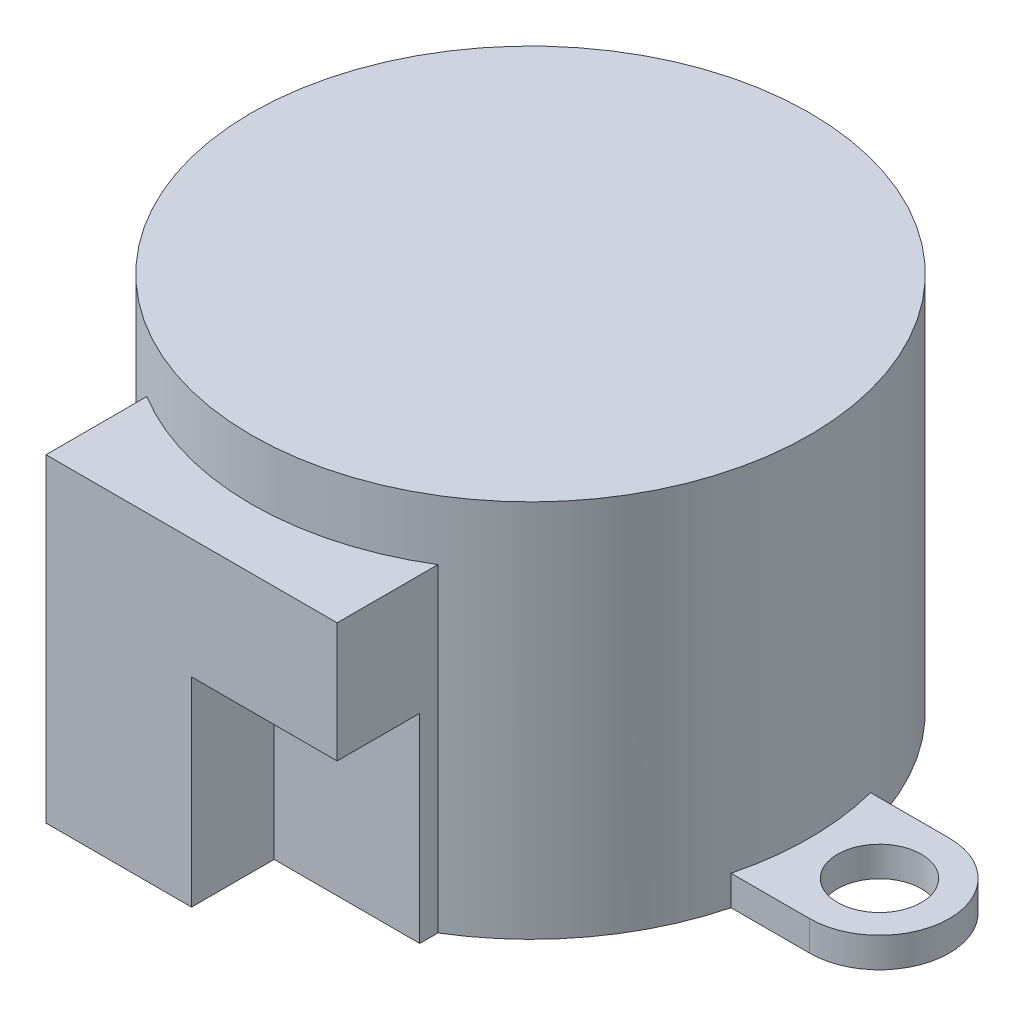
ISO-10303-21;
HEADER;
FILE_DESCRIPTION(('STEP AP214'),'2;1');
FILE_NAME('part.step','',(''),(''),'','','');
FILE_SCHEMA(('AUTOMOTIVE_DESIGN { 1 0 10303 214 1 1 1 1 }'));
ENDSEC;
DATA;
#1=APPLICATION_CONTEXT('core data for automotive mechanical design processes');
#2=APPLICATION_PROTOCOL_DEFINITION('international standard','automotive_design',2000,#1);
#3=PRODUCT_CONTEXT('',#1,'mechanical');
#4=PRODUCT('Part','Part','',(#3));
#5=PRODUCT_RELATED_PRODUCT_CATEGORY('part','',(#4));
#6=PRODUCT_DEFINITION_FORMATION('','',#4);
#7=PRODUCT_DEFINITION_CONTEXT('part definition',#1,'design');
#8=PRODUCT_DEFINITION('design','',#6,#7);
#9=PRODUCT_DEFINITION_SHAPE('','',#8);
#10=(LENGTH_UNIT() NAMED_UNIT(*) SI_UNIT(.MILLI.,.METRE.));
#11=(NAMED_UNIT(*) PLANE_ANGLE_UNIT() SI_UNIT($,.RADIAN.));
#12=(NAMED_UNIT(*) SI_UNIT($,.STERADIAN.) SOLID_ANGLE_UNIT());
#13=UNCERTAINTY_MEASURE_WITH_UNIT(LENGTH_MEASURE(1.E-05),#10,'distance_accuracy_value','');
#14=(GEOMETRIC_REPRESENTATION_CONTEXT(3) GLOBAL_UNCERTAINTY_ASSIGNED_CONTEXT((#13)) GLOBAL_UNIT_ASSIGNED_CONTEXT((#10,
#11,#12)) REPRESENTATION_CONTEXT('',''));
#15=CARTESIAN_POINT('',(0.,0.,0.));
#16=DIRECTION('',(0.,0.,1.));
#17=DIRECTION('',(1.,0.,0.));
#18=AXIS2_PLACEMENT_3D('',#15,#16,#17);
#19=CARTESIAN_POINT('',(0.,19.,0.));
#20=DIRECTION('',(0.,-1.,0.));
#21=DIRECTION('',(0.,0.,-1.));
#22=AXIS2_PLACEMENT_3D('',#19,#20,#21);
#23=CYLINDRICAL_SURFACE('',#22,14.);
#24=CARTESIAN_POINT('',(0.,19.,0.));
#25=DIRECTION('',(0.,1.,0.));
#26=DIRECTION('',(0.,0.,1.));
#27=AXIS2_PLACEMENT_3D('',#24,#25,#26);
#28=CIRCLE('',#27,14.);
#29=CARTESIAN_POINT('',(0.,19.,14.));
#30=VERTEX_POINT('',#29);
#31=EDGE_CURVE('E320',#30,#30,#28,.T.);
#32=ORIENTED_EDGE('',*,*,#31,.F.);
#33=EDGE_LOOP('',(#32));
#34=FACE_BOUND('',#33,.T.);
#35=DIRECTION('',(0.,-1.,0.));
#36=VECTOR('',#35,1.);
#37=CARTESIAN_POINT('',(-13.555441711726,1.5,3.5));
#38=LINE('',#37,#36);
#39=CARTESIAN_POINT('',(-13.555441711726,1.5,3.5));
#40=VERTEX_POINT('',#39);
#41=CARTESIAN_POINT('',(-13.555441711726,0.,3.5));
#42=VERTEX_POINT('',#41);
#43=EDGE_CURVE('E246',#40,#42,#38,.T.);
#44=ORIENTED_EDGE('',*,*,#43,.T.);
#45=CARTESIAN_POINT('',(0.,0.,0.));
#46=DIRECTION('',(0.,1.,0.));
#47=DIRECTION('',(0.,0.,1.));
#48=AXIS2_PLACEMENT_3D('',#45,#46,#47);
#49=CIRCLE('',#48,14.);
#50=CARTESIAN_POINT('',(-7.3,0.,11.9461290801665));
#51=VERTEX_POINT('',#50);
#52=EDGE_CURVE('E319',#42,#51,#49,.T.);
#53=ORIENTED_EDGE('',*,*,#52,.T.);
#54=DIRECTION('',(0.,-1.,0.));
#55=VECTOR('',#54,1.);
#56=CARTESIAN_POINT('',(-7.3,19.,11.9461290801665));
#57=LINE('',#56,#55);
#58=CARTESIAN_POINT('',(-7.3,16.,11.9461290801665));
#59=VERTEX_POINT('',#58);
#60=EDGE_CURVE('E11',#59,#51,#57,.T.);
#61=ORIENTED_EDGE('',*,*,#60,.F.);
#62=CARTESIAN_POINT('',(0.,16.,0.));
#63=DIRECTION('',(0.,-1.,0.));
#64=DIRECTION('',(0.,0.,1.));
#65=AXIS2_PLACEMENT_3D('',#62,#63,#64);
#66=CIRCLE('',#65,14.);
#67=CARTESIAN_POINT('',(7.3,16.,11.9461290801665));
#68=VERTEX_POINT('',#67);
#69=EDGE_CURVE('E250',#68,#59,#66,.T.);
#70=ORIENTED_EDGE('',*,*,#69,.F.);
#71=DIRECTION('',(0.,-1.,0.));
#72=VECTOR('',#71,1.);
#73=CARTESIAN_POINT('',(7.3,19.,11.9461290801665));
#74=LINE('',#73,#72);
#75=CARTESIAN_POINT('',(7.3,0.,11.9461290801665));
#76=VERTEX_POINT('',#75);
#77=EDGE_CURVE('E324',#68,#76,#74,.T.);
#78=ORIENTED_EDGE('',*,*,#77,.T.);
#79=CARTESIAN_POINT('',(13.555441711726,0.,3.5));
#80=VERTEX_POINT('',#79);
#81=EDGE_CURVE('E326',#76,#80,#49,.T.);
#82=ORIENTED_EDGE('',*,*,#81,.T.);
#83=DIRECTION('',(0.,-1.,0.));
#84=VECTOR('',#83,1.);
#85=CARTESIAN_POINT('',(13.555441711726,1.5,3.5));
#86=LINE('',#85,#84);
#87=CARTESIAN_POINT('',(13.555441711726,1.5,3.5));
#88=VERTEX_POINT('',#87);
#89=EDGE_CURVE('E301',#88,#80,#86,.T.);
#90=ORIENTED_EDGE('',*,*,#89,.F.);
#91=CARTESIAN_POINT('',(0.,1.5,0.));
#92=DIRECTION('',(0.,-1.,0.));
#93=DIRECTION('',(0.,0.,-1.));
#94=AXIS2_PLACEMENT_3D('',#91,#92,#93);
#95=CIRCLE('',#94,14.);
#96=CARTESIAN_POINT('',(13.555441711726,1.5,-3.5));
#97=VERTEX_POINT('',#96);
#98=EDGE_CURVE('E267',#97,#88,#95,.T.);
#99=ORIENTED_EDGE('',*,*,#98,.F.);
#100=DIRECTION('',(0.,-1.,0.));
#101=VECTOR('',#100,1.);
#102=CARTESIAN_POINT('',(13.555441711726,1.5,-3.5));
#103=LINE('',#102,#101);
#104=CARTESIAN_POINT('',(13.555441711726,0.,-3.5));
#105=VERTEX_POINT('',#104);
#106=EDGE_CURVE('E297',#97,#105,#103,.T.);
#107=ORIENTED_EDGE('',*,*,#106,.T.);
#108=CARTESIAN_POINT('',(-13.555441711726,0.,-3.5));
#109=VERTEX_POINT('',#108);
#110=EDGE_CURVE('E330',#105,#109,#49,.T.);
#111=ORIENTED_EDGE('',*,*,#110,.T.);
#112=DIRECTION('',(0.,-1.,0.));
#113=VECTOR('',#112,1.);
#114=CARTESIAN_POINT('',(-13.555441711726,1.5,-3.5));
#115=LINE('',#114,#113);
#116=CARTESIAN_POINT('',(-13.555441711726,1.5,-3.5));
#117=VERTEX_POINT('',#116);
#118=EDGE_CURVE('E67',#117,#109,#115,.T.);
#119=ORIENTED_EDGE('',*,*,#118,.F.);
#120=CARTESIAN_POINT('',(0.,1.5,0.));
#121=DIRECTION('',(0.,-1.,0.));
#122=DIRECTION('',(0.,0.,-1.));
#123=AXIS2_PLACEMENT_3D('',#120,#121,#122);
#124=CIRCLE('',#123,14.);
#125=EDGE_CURVE('E226',#40,#117,#124,.T.);
#126=ORIENTED_EDGE('',*,*,#125,.F.);
#127=EDGE_LOOP('',(#44,#53,#61,#70,#78,#82,#90,#99,#107,#111,#119,#126));
#128=FACE_BOUND('',#127,.T.);
#129=ADVANCED_FACE('F44',(#34,#128),#23,.T.);
#130=CARTESIAN_POINT('',(-7.3,19.,11.9461290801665));
#131=DIRECTION('',(1.,0.,0.));
#132=DIRECTION('',(0.,0.,-1.));
#133=AXIS2_PLACEMENT_3D('',#130,#131,#132);
#134=PLANE('',#133);
#135=DIRECTION('',(0.,0.,1.));
#136=VECTOR('',#135,1.);
#137=CARTESIAN_POINT('',(-7.3,16.,11.9461290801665));
#138=LINE('',#137,#136);
#139=CARTESIAN_POINT('',(-7.3,16.,17.));
#140=VERTEX_POINT('',#139);
#141=EDGE_CURVE('E309',#59,#140,#138,.T.);
#142=ORIENTED_EDGE('',*,*,#141,.F.);
#143=ORIENTED_EDGE('',*,*,#60,.T.);
#144=DIRECTION('',(0.,0.,1.));
#145=VECTOR('',#144,1.);
#146=CARTESIAN_POINT('',(-7.3,0.,11.9461290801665));
#147=LINE('',#146,#145);
#148=CARTESIAN_POINT('',(-7.3,0.,17.));
#149=VERTEX_POINT('',#148);
#150=EDGE_CURVE('E329',#51,#149,#147,.T.);
#151=ORIENTED_EDGE('',*,*,#150,.T.);
#152=DIRECTION('',(0.,-1.,0.));
#153=VECTOR('',#152,1.);
#154=CARTESIAN_POINT('',(-7.3,19.,17.));
#155=LINE('',#154,#153);
#156=EDGE_CURVE('E52',#140,#149,#155,.T.);
#157=ORIENTED_EDGE('',*,*,#156,.F.);
#158=EDGE_LOOP('',(#142,#143,#151,#157));
#159=FACE_BOUND('',#158,.T.);
#160=ADVANCED_FACE('F349',(#159),#134,.F.);
#161=CARTESIAN_POINT('',(-7.3,19.,17.));
#162=DIRECTION('',(0.,0.,-1.));
#163=DIRECTION('',(-1.,0.,0.));
#164=AXIS2_PLACEMENT_3D('',#161,#162,#163);
#165=PLANE('',#164);
#166=DIRECTION('',(1.,0.,0.));
#167=VECTOR('',#166,1.);
#168=CARTESIAN_POINT('',(-7.3,0.,17.));
#169=LINE('',#168,#167);
#170=CARTESIAN_POINT('',(0.,0.,17.));
#171=VERTEX_POINT('',#170);
#172=EDGE_CURVE('E174',#149,#171,#169,.T.);
#173=ORIENTED_EDGE('',*,*,#172,.T.);
#174=DIRECTION('',(0.,-1.,0.));
#175=VECTOR('',#174,1.);
#176=CARTESIAN_POINT('',(0.,10.,17.));
#177=LINE('',#176,#175);
#178=CARTESIAN_POINT('',(0.,10.,17.));
#179=VERTEX_POINT('',#178);
#180=EDGE_CURVE('E59',#179,#171,#177,.T.);
#181=ORIENTED_EDGE('',*,*,#180,.F.);
#182=DIRECTION('',(-1.,0.,0.));
#183=VECTOR('',#182,1.);
#184=CARTESIAN_POINT('',(7.3,10.,17.));
#185=LINE('',#184,#183);
#186=CARTESIAN_POINT('',(7.3,10.,17.));
#187=VERTEX_POINT('',#186);
#188=EDGE_CURVE('E159',#187,#179,#185,.T.);
#189=ORIENTED_EDGE('',*,*,#188,.F.);
#190=DIRECTION('',(0.,-1.,0.));
#191=VECTOR('',#190,1.);
#192=CARTESIAN_POINT('',(7.3,19.,17.));
#193=LINE('',#192,#191);
#194=CARTESIAN_POINT('',(7.3,16.,17.));
#195=VERTEX_POINT('',#194);
#196=EDGE_CURVE('E341',#195,#187,#193,.T.);
#197=ORIENTED_EDGE('',*,*,#196,.F.);
#198=DIRECTION('',(1.,0.,0.));
#199=VECTOR('',#198,1.);
#200=CARTESIAN_POINT('',(-7.3,16.,17.));
#201=LINE('',#200,#199);
#202=EDGE_CURVE('E312',#140,#195,#201,.T.);
#203=ORIENTED_EDGE('',*,*,#202,.F.);
#204=ORIENTED_EDGE('',*,*,#156,.T.);
#205=EDGE_LOOP('',(#173,#181,#189,#197,#203,#204));
#206=FACE_BOUND('',#205,.T.);
#207=ADVANCED_FACE('F172',(#206),#165,.F.);
#208=CARTESIAN_POINT('',(7.3,19.,17.));
#209=DIRECTION('',(-1.,0.,0.));
#210=DIRECTION('',(0.,0.,1.));
#211=AXIS2_PLACEMENT_3D('',#208,#209,#210);
#212=PLANE('',#211);
#213=DIRECTION('',(0.,0.,1.));
#214=VECTOR('',#213,1.);
#215=CARTESIAN_POINT('',(7.3,10.,12.8566137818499));
#216=LINE('',#215,#214);
#217=CARTESIAN_POINT('',(7.3,10.,12.8566137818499));
#218=VERTEX_POINT('',#217);
#219=EDGE_CURVE('E164',#218,#187,#216,.T.);
#220=ORIENTED_EDGE('',*,*,#219,.F.);
#221=DIRECTION('',(0.,-1.,0.));
#222=VECTOR('',#221,1.);
#223=CARTESIAN_POINT('',(7.3,10.,12.8566137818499));
#224=LINE('',#223,#222);
#225=CARTESIAN_POINT('',(7.3,0.,12.8566137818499));
#226=VERTEX_POINT('',#225);
#227=EDGE_CURVE('E179',#218,#226,#224,.T.);
#228=ORIENTED_EDGE('',*,*,#227,.T.);
#229=DIRECTION('',(0.,0.,-1.));
#230=VECTOR('',#229,1.);
#231=CARTESIAN_POINT('',(7.3,0.,17.));
#232=LINE('',#231,#230);
#233=EDGE_CURVE('E325',#226,#76,#232,.T.);
#234=ORIENTED_EDGE('',*,*,#233,.T.);
#235=ORIENTED_EDGE('',*,*,#77,.F.);
#236=DIRECTION('',(0.,0.,-1.));
#237=VECTOR('',#236,1.);
#238=CARTESIAN_POINT('',(7.3,16.,17.));
#239=LINE('',#238,#237);
#240=EDGE_CURVE('E315',#195,#68,#239,.T.);
#241=ORIENTED_EDGE('',*,*,#240,.F.);
#242=ORIENTED_EDGE('',*,*,#196,.T.);
#243=EDGE_LOOP('',(#220,#228,#234,#235,#241,#242));
#244=FACE_BOUND('',#243,.T.);
#245=ADVANCED_FACE('F365',(#244),#212,.F.);
#246=CARTESIAN_POINT('',(0.,19.,0.));
#247=DIRECTION('',(0.,1.,0.));
#248=DIRECTION('',(0.,0.,1.));
#249=AXIS2_PLACEMENT_3D('',#246,#247,#248);
#250=PLANE('',#249);
#251=ORIENTED_EDGE('',*,*,#31,.T.);
#252=EDGE_LOOP('',(#251));
#253=FACE_BOUND('',#252,.T.);
#254=ADVANCED_FACE('F420',(#253),#250,.T.);
#255=CARTESIAN_POINT('',(0.,0.,0.));
#256=DIRECTION('',(0.,1.,0.));
#257=DIRECTION('',(0.,0.,1.));
#258=AXIS2_PLACEMENT_3D('',#255,#256,#257);
#259=PLANE('',#258);
#260=CARTESIAN_POINT('',(0.,0.,-8.));
#261=DIRECTION('',(0.,1.,0.));
#262=DIRECTION('',(-1.,0.,0.));
#263=AXIS2_PLACEMENT_3D('',#260,#261,#262);
#264=CIRCLE('',#263,4.5);
#265=CARTESIAN_POINT('',(-4.5,0.,-8.));
#266=VERTEX_POINT('',#265);
#267=EDGE_CURVE('E204',#266,#266,#264,.T.);
#268=ORIENTED_EDGE('',*,*,#267,.T.);
#269=EDGE_LOOP('',(#268));
#270=FACE_BOUND('',#269,.T.);
#271=ORIENTED_EDGE('',*,*,#233,.F.);
#272=DIRECTION('',(1.,0.,0.));
#273=VECTOR('',#272,1.);
#274=CARTESIAN_POINT('',(0.,0.,12.8566137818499));
#275=LINE('',#274,#273);
#276=CARTESIAN_POINT('',(0.,0.,12.8566137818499));
#277=VERTEX_POINT('',#276);
#278=EDGE_CURVE('E169',#277,#226,#275,.T.);
#279=ORIENTED_EDGE('',*,*,#278,.F.);
#280=DIRECTION('',(0.,0.,-1.));
#281=VECTOR('',#280,1.);
#282=CARTESIAN_POINT('',(0.,0.,17.));
#283=LINE('',#282,#281);
#284=EDGE_CURVE('E356',#171,#277,#283,.T.);
#285=ORIENTED_EDGE('',*,*,#284,.F.);
#286=ORIENTED_EDGE('',*,*,#172,.F.);
#287=ORIENTED_EDGE('',*,*,#150,.F.);
#288=ORIENTED_EDGE('',*,*,#52,.F.);
#289=DIRECTION('',(1.,0.,0.));
#290=VECTOR('',#289,1.);
#291=CARTESIAN_POINT('',(0.,0.,3.5));
#292=LINE('',#291,#290);
#293=CARTESIAN_POINT('',(-17.5,0.,3.5));
#294=VERTEX_POINT('',#293);
#295=EDGE_CURVE('E234',#294,#42,#292,.T.);
#296=ORIENTED_EDGE('',*,*,#295,.F.);
#297=CARTESIAN_POINT('',(-17.5,0.,0.));
#298=DIRECTION('',(0.,-1.,0.));
#299=DIRECTION('',(0.,0.,-1.));
#300=AXIS2_PLACEMENT_3D('',#297,#298,#299);
#301=CIRCLE('',#300,3.5);
#302=CARTESIAN_POINT('',(-17.5,0.,-3.5));
#303=VERTEX_POINT('',#302);
#304=EDGE_CURVE('E239',#294,#303,#301,.T.);
#305=ORIENTED_EDGE('',*,*,#304,.T.);
#306=DIRECTION('',(1.,0.,0.));
#307=VECTOR('',#306,1.);
#308=CARTESIAN_POINT('',(0.,0.,-3.5));
#309=LINE('',#308,#307);
#310=EDGE_CURVE('E214',#303,#109,#309,.T.);
#311=ORIENTED_EDGE('',*,*,#310,.T.);
#312=ORIENTED_EDGE('',*,*,#110,.F.);
#313=DIRECTION('',(-1.,0.,0.));
#314=VECTOR('',#313,1.);
#315=CARTESIAN_POINT('',(0.,0.,-3.5));
#316=LINE('',#315,#314);
#317=CARTESIAN_POINT('',(17.5,0.,-3.5));
#318=VERTEX_POINT('',#317);
#319=EDGE_CURVE('E287',#318,#105,#316,.T.);
#320=ORIENTED_EDGE('',*,*,#319,.F.);
#321=CARTESIAN_POINT('',(17.5,0.,0.));
#322=DIRECTION('',(0.,-1.,0.));
#323=DIRECTION('',(0.,0.,-1.));
#324=AXIS2_PLACEMENT_3D('',#321,#322,#323);
#325=CIRCLE('',#324,3.5);
#326=CARTESIAN_POINT('',(17.5,0.,3.5));
#327=VERTEX_POINT('',#326);
#328=EDGE_CURVE('E208',#327,#318,#325,.F.);
#329=ORIENTED_EDGE('',*,*,#328,.F.);
#330=DIRECTION('',(-1.,0.,0.));
#331=VECTOR('',#330,1.);
#332=CARTESIAN_POINT('',(0.,0.,3.5));
#333=LINE('',#332,#331);
#334=EDGE_CURVE('E283',#327,#80,#333,.T.);
#335=ORIENTED_EDGE('',*,*,#334,.T.);
#336=ORIENTED_EDGE('',*,*,#81,.F.);
#337=EDGE_LOOP('',(#271,#279,#285,#286,#287,#288,#296,#305,#311,#312,#320,#329,#335,#336));
#338=FACE_BOUND('',#337,.T.);
#339=CARTESIAN_POINT('',(17.5,0.,0.));
#340=DIRECTION('',(0.,-1.,0.));
#341=DIRECTION('',(0.,0.,-1.));
#342=AXIS2_PLACEMENT_3D('',#339,#340,#341);
#343=CIRCLE('',#342,2.1);
#344=CARTESIAN_POINT('',(17.5,0.,-2.1));
#345=VERTEX_POINT('',#344);
#346=EDGE_CURVE('E263',#345,#345,#343,.F.);
#347=ORIENTED_EDGE('',*,*,#346,.T.);
#348=EDGE_LOOP('',(#347));
#349=FACE_BOUND('',#348,.T.);
#350=CARTESIAN_POINT('',(-17.5,0.,0.));
#351=DIRECTION('',(0.,-1.,0.));
#352=DIRECTION('',(0.,0.,-1.));
#353=AXIS2_PLACEMENT_3D('',#350,#351,#352);
#354=CIRCLE('',#353,2.1);
#355=CARTESIAN_POINT('',(-17.5,0.,-2.1));
#356=VERTEX_POINT('',#355);
#357=EDGE_CURVE('E230',#356,#356,#354,.T.);
#358=ORIENTED_EDGE('',*,*,#357,.F.);
#359=EDGE_LOOP('',(#358));
#360=FACE_BOUND('',#359,.T.);
#361=ADVANCED_FACE('F353',(#270,#338,#349,#360),#259,.F.);
#362=CARTESIAN_POINT('',(0.,16.,0.));
#363=DIRECTION('',(0.,1.,0.));
#364=DIRECTION('',(0.,0.,1.));
#365=AXIS2_PLACEMENT_3D('',#362,#363,#364);
#366=PLANE('',#365);
#367=ORIENTED_EDGE('',*,*,#69,.T.);
#368=ORIENTED_EDGE('',*,*,#141,.T.);
#369=ORIENTED_EDGE('',*,*,#202,.T.);
#370=ORIENTED_EDGE('',*,*,#240,.T.);
#371=EDGE_LOOP('',(#367,#368,#369,#370));
#372=FACE_BOUND('',#371,.T.);
#373=ADVANCED_FACE('F426',(#372),#366,.T.);
#374=CARTESIAN_POINT('',(17.5,1.5,0.));
#375=DIRECTION('',(0.,-1.,0.));
#376=DIRECTION('',(0.,0.,-1.));
#377=AXIS2_PLACEMENT_3D('',#374,#375,#376);
#378=CYLINDRICAL_SURFACE('',#377,3.5);
#379=ORIENTED_EDGE('',*,*,#328,.T.);
#380=DIRECTION('',(0.,-1.,0.));
#381=VECTOR('',#380,1.);
#382=CARTESIAN_POINT('',(17.5,1.5,-3.5));
#383=LINE('',#382,#381);
#384=CARTESIAN_POINT('',(17.5,1.5,-3.5));
#385=VERTEX_POINT('',#384);
#386=EDGE_CURVE('E235',#385,#318,#383,.T.);
#387=ORIENTED_EDGE('',*,*,#386,.F.);
#388=CARTESIAN_POINT('',(17.5,1.5,0.));
#389=DIRECTION('',(0.,-1.,0.));
#390=DIRECTION('',(0.,0.,-1.));
#391=AXIS2_PLACEMENT_3D('',#388,#389,#390);
#392=CIRCLE('',#391,3.5);
#393=CARTESIAN_POINT('',(17.5,1.5,3.5));
#394=VERTEX_POINT('',#393);
#395=EDGE_CURVE('E258',#394,#385,#392,.F.);
#396=ORIENTED_EDGE('',*,*,#395,.F.);
#397=DIRECTION('',(0.,-1.,0.));
#398=VECTOR('',#397,1.);
#399=CARTESIAN_POINT('',(17.5,1.5,3.5));
#400=LINE('',#399,#398);
#401=EDGE_CURVE('E279',#394,#327,#400,.T.);
#402=ORIENTED_EDGE('',*,*,#401,.T.);
#403=EDGE_LOOP('',(#379,#387,#396,#402));
#404=FACE_BOUND('',#403,.T.);
#405=ADVANCED_FACE('F586',(#404),#378,.T.);
#406=CARTESIAN_POINT('',(0.,1.5,-3.5));
#407=DIRECTION('',(0.,0.,1.));
#408=DIRECTION('',(1.,0.,0.));
#409=AXIS2_PLACEMENT_3D('',#406,#407,#408);
#410=PLANE('',#409);
#411=ORIENTED_EDGE('',*,*,#319,.T.);
#412=ORIENTED_EDGE('',*,*,#106,.F.);
#413=DIRECTION('',(-1.,0.,0.));
#414=VECTOR('',#413,1.);
#415=CARTESIAN_POINT('',(0.,1.5,-3.5));
#416=LINE('',#415,#414);
#417=EDGE_CURVE('E271',#385,#97,#416,.T.);
#418=ORIENTED_EDGE('',*,*,#417,.F.);
#419=ORIENTED_EDGE('',*,*,#386,.T.);
#420=EDGE_LOOP('',(#411,#412,#418,#419));
#421=FACE_BOUND('',#420,.T.);
#422=ADVANCED_FACE('F381',(#421),#410,.F.);
#423=CARTESIAN_POINT('',(0.,1.5,3.5));
#424=DIRECTION('',(0.,0.,1.));
#425=DIRECTION('',(1.,0.,0.));
#426=AXIS2_PLACEMENT_3D('',#423,#424,#425);
#427=PLANE('',#426);
#428=ORIENTED_EDGE('',*,*,#334,.F.);
#429=ORIENTED_EDGE('',*,*,#401,.F.);
#430=DIRECTION('',(-1.,0.,0.));
#431=VECTOR('',#430,1.);
#432=CARTESIAN_POINT('',(0.,1.5,3.5));
#433=LINE('',#432,#431);
#434=EDGE_CURVE('E262',#394,#88,#433,.T.);
#435=ORIENTED_EDGE('',*,*,#434,.T.);
#436=ORIENTED_EDGE('',*,*,#89,.T.);
#437=EDGE_LOOP('',(#428,#429,#435,#436));
#438=FACE_BOUND('',#437,.T.);
#439=ADVANCED_FACE('F372',(#438),#427,.T.);
#440=CARTESIAN_POINT('',(17.5,1.5,0.));
#441=DIRECTION('',(0.,-1.,0.));
#442=DIRECTION('',(0.,0.,-1.));
#443=AXIS2_PLACEMENT_3D('',#440,#441,#442);
#444=CYLINDRICAL_SURFACE('',#443,2.1);
#445=CARTESIAN_POINT('',(17.5,1.5,0.));
#446=DIRECTION('',(0.,-1.,0.));
#447=DIRECTION('',(0.,0.,-1.));
#448=AXIS2_PLACEMENT_3D('',#445,#446,#447);
#449=CIRCLE('',#448,2.1);
#450=CARTESIAN_POINT('',(17.5,1.5,-2.1));
#451=VERTEX_POINT('',#450);
#452=EDGE_CURVE('E275',#451,#451,#449,.F.);
#453=ORIENTED_EDGE('',*,*,#452,.T.);
#454=EDGE_LOOP('',(#453));
#455=FACE_BOUND('',#454,.T.);
#456=ORIENTED_EDGE('',*,*,#346,.F.);
#457=EDGE_LOOP('',(#456));
#458=FACE_BOUND('',#457,.T.);
#459=ADVANCED_FACE('F407',(#455,#458),#444,.F.);
#460=CARTESIAN_POINT('',(0.,1.5,0.));
#461=DIRECTION('',(0.,-1.,0.));
#462=DIRECTION('',(0.,0.,-1.));
#463=AXIS2_PLACEMENT_3D('',#460,#461,#462);
#464=PLANE('',#463);
#465=ORIENTED_EDGE('',*,*,#395,.T.);
#466=ORIENTED_EDGE('',*,*,#417,.T.);
#467=ORIENTED_EDGE('',*,*,#98,.T.);
#468=ORIENTED_EDGE('',*,*,#434,.F.);
#469=EDGE_LOOP('',(#465,#466,#467,#468));
#470=FACE_BOUND('',#469,.T.);
#471=ORIENTED_EDGE('',*,*,#452,.F.);
#472=EDGE_LOOP('',(#471));
#473=FACE_BOUND('',#472,.T.);
#474=ADVANCED_FACE('F376',(#470,#473),#464,.F.);
#475=CARTESIAN_POINT('',(0.,1.5,3.5));
#476=DIRECTION('',(0.,0.,-1.));
#477=DIRECTION('',(-1.,0.,0.));
#478=AXIS2_PLACEMENT_3D('',#475,#476,#477);
#479=PLANE('',#478);
#480=ORIENTED_EDGE('',*,*,#295,.T.);
#481=ORIENTED_EDGE('',*,*,#43,.F.);
#482=DIRECTION('',(1.,0.,0.));
#483=VECTOR('',#482,1.);
#484=CARTESIAN_POINT('',(0.,1.5,3.5));
#485=LINE('',#484,#483);
#486=CARTESIAN_POINT('',(-17.5,1.5,3.5));
#487=VERTEX_POINT('',#486);
#488=EDGE_CURVE('E213',#487,#40,#485,.T.);
#489=ORIENTED_EDGE('',*,*,#488,.F.);
#490=DIRECTION('',(0.,-1.,0.));
#491=VECTOR('',#490,1.);
#492=CARTESIAN_POINT('',(-17.5,1.5,3.5));
#493=LINE('',#492,#491);
#494=EDGE_CURVE('E229',#487,#294,#493,.T.);
#495=ORIENTED_EDGE('',*,*,#494,.T.);
#496=EDGE_LOOP('',(#480,#481,#489,#495));
#497=FACE_BOUND('',#496,.T.);
#498=ADVANCED_FACE('F398',(#497),#479,.F.);
#499=CARTESIAN_POINT('',(0.,1.5,-3.5));
#500=DIRECTION('',(0.,0.,-1.));
#501=DIRECTION('',(-1.,0.,0.));
#502=AXIS2_PLACEMENT_3D('',#499,#500,#501);
#503=PLANE('',#502);
#504=ORIENTED_EDGE('',*,*,#310,.F.);
#505=DIRECTION('',(0.,-1.,0.));
#506=VECTOR('',#505,1.);
#507=CARTESIAN_POINT('',(-17.5,1.5,-3.5));
#508=LINE('',#507,#506);
#509=CARTESIAN_POINT('',(-17.5,1.5,-3.5));
#510=VERTEX_POINT('',#509);
#511=EDGE_CURVE('E253',#510,#303,#508,.T.);
#512=ORIENTED_EDGE('',*,*,#511,.F.);
#513=DIRECTION('',(1.,0.,0.));
#514=VECTOR('',#513,1.);
#515=CARTESIAN_POINT('',(0.,1.5,-3.5));
#516=LINE('',#515,#514);
#517=EDGE_CURVE('E222',#510,#117,#516,.T.);
#518=ORIENTED_EDGE('',*,*,#517,.T.);
#519=ORIENTED_EDGE('',*,*,#118,.T.);
#520=EDGE_LOOP('',(#504,#512,#518,#519));
#521=FACE_BOUND('',#520,.T.);
#522=ADVANCED_FACE('F395',(#521),#503,.T.);
#523=CARTESIAN_POINT('',(-17.5,1.5,0.));
#524=DIRECTION('',(0.,-1.,0.));
#525=DIRECTION('',(0.,0.,-1.));
#526=AXIS2_PLACEMENT_3D('',#523,#524,#525);
#527=CYLINDRICAL_SURFACE('',#526,2.1);
#528=CARTESIAN_POINT('',(-17.5,1.5,0.));
#529=DIRECTION('',(0.,-1.,0.));
#530=DIRECTION('',(0.,0.,-1.));
#531=AXIS2_PLACEMENT_3D('',#528,#529,#530);
#532=CIRCLE('',#531,2.1);
#533=CARTESIAN_POINT('',(-17.5,1.5,-2.1));
#534=VERTEX_POINT('',#533);
#535=EDGE_CURVE('E209',#534,#534,#532,.T.);
#536=ORIENTED_EDGE('',*,*,#535,.F.);
#537=EDGE_LOOP('',(#536));
#538=FACE_BOUND('',#537,.T.);
#539=ORIENTED_EDGE('',*,*,#357,.T.);
#540=EDGE_LOOP('',(#539));
#541=FACE_BOUND('',#540,.T.);
#542=ADVANCED_FACE('F405',(#538,#541),#527,.F.);
#543=CARTESIAN_POINT('',(-17.5,1.5,0.));
#544=DIRECTION('',(0.,-1.,0.));
#545=DIRECTION('',(0.,0.,-1.));
#546=AXIS2_PLACEMENT_3D('',#543,#544,#545);
#547=CYLINDRICAL_SURFACE('',#546,3.5);
#548=ORIENTED_EDGE('',*,*,#304,.F.);
#549=ORIENTED_EDGE('',*,*,#494,.F.);
#550=CARTESIAN_POINT('',(-17.5,1.5,0.));
#551=DIRECTION('',(0.,-1.,0.));
#552=DIRECTION('',(0.,0.,-1.));
#553=AXIS2_PLACEMENT_3D('',#550,#551,#552);
#554=CIRCLE('',#553,3.5);
#555=EDGE_CURVE('E218',#487,#510,#554,.T.);
#556=ORIENTED_EDGE('',*,*,#555,.T.);
#557=ORIENTED_EDGE('',*,*,#511,.T.);
#558=EDGE_LOOP('',(#548,#549,#556,#557));
#559=FACE_BOUND('',#558,.T.);
#560=ADVANCED_FACE('F390',(#559),#547,.T.);
#561=CARTESIAN_POINT('',(0.,1.5,0.));
#562=DIRECTION('',(0.,-1.,0.));
#563=DIRECTION('',(0.,0.,-1.));
#564=AXIS2_PLACEMENT_3D('',#561,#562,#563);
#565=PLANE('',#564);
#566=ORIENTED_EDGE('',*,*,#535,.T.);
#567=EDGE_LOOP('',(#566));
#568=FACE_BOUND('',#567,.T.);
#569=ORIENTED_EDGE('',*,*,#488,.T.);
#570=ORIENTED_EDGE('',*,*,#125,.T.);
#571=ORIENTED_EDGE('',*,*,#517,.F.);
#572=ORIENTED_EDGE('',*,*,#555,.F.);
#573=EDGE_LOOP('',(#569,#570,#571,#572));
#574=FACE_BOUND('',#573,.T.);
#575=ADVANCED_FACE('F397',(#568,#574),#565,.F.);
#576=CARTESIAN_POINT('',(0.,0.,-8.));
#577=DIRECTION('',(0.,1.,0.));
#578=DIRECTION('',(-1.,0.,0.));
#579=AXIS2_PLACEMENT_3D('',#576,#577,#578);
#580=CYLINDRICAL_SURFACE('',#579,4.5);
#581=CARTESIAN_POINT('',(0.,-1.5,-8.));
#582=DIRECTION('',(0.,1.,0.));
#583=DIRECTION('',(-1.,0.,0.));
#584=AXIS2_PLACEMENT_3D('',#581,#582,#583);
#585=CIRCLE('',#584,4.5);
#586=CARTESIAN_POINT('',(-4.5,-1.5,-8.));
#587=VERTEX_POINT('',#586);
#588=EDGE_CURVE('E200',#587,#587,#585,.T.);
#589=ORIENTED_EDGE('',*,*,#588,.T.);
#590=EDGE_LOOP('',(#589));
#591=FACE_BOUND('',#590,.T.);
#592=ORIENTED_EDGE('',*,*,#267,.F.);
#593=EDGE_LOOP('',(#592));
#594=FACE_BOUND('',#593,.T.);
#595=ADVANCED_FACE('F519',(#591,#594),#580,.T.);
#596=CARTESIAN_POINT('',(4.5,-1.5,-8.));
#597=DIRECTION('',(0.,-1.,0.));
#598=DIRECTION('',(1.,0.,0.));
#599=AXIS2_PLACEMENT_3D('',#596,#597,#598);
#600=PLANE('',#599);
#601=CARTESIAN_POINT('',(0.,-1.5,-8.));
#602=DIRECTION('',(0.,1.,0.));
#603=DIRECTION('',(-1.,0.,0.));
#604=AXIS2_PLACEMENT_3D('',#601,#602,#603);
#605=CIRCLE('',#604,2.5);
#606=CARTESIAN_POINT('',(-2.5,-1.5,-8.));
#607=VERTEX_POINT('',#606);
#608=EDGE_CURVE('E196',#607,#607,#605,.T.);
#609=ORIENTED_EDGE('',*,*,#608,.T.);
#610=EDGE_LOOP('',(#609));
#611=FACE_BOUND('',#610,.T.);
#612=ORIENTED_EDGE('',*,*,#588,.F.);
#613=EDGE_LOOP('',(#612));
#614=FACE_BOUND('',#613,.T.);
#615=ADVANCED_FACE('F510',(#611,#614),#600,.T.);
#616=CARTESIAN_POINT('',(0.,0.,-8.));
#617=DIRECTION('',(0.,1.,0.));
#618=DIRECTION('',(-1.,0.,0.));
#619=AXIS2_PLACEMENT_3D('',#616,#617,#618);
#620=CYLINDRICAL_SURFACE('',#619,2.5);
#621=CARTESIAN_POINT('',(0.,-4.,-8.));
#622=DIRECTION('',(0.,1.,0.));
#623=DIRECTION('',(-1.,0.,0.));
#624=AXIS2_PLACEMENT_3D('',#621,#622,#623);
#625=CIRCLE('',#624,2.5);
#626=CARTESIAN_POINT('',(-2.5,-4.,-8.));
#627=VERTEX_POINT('',#626);
#628=EDGE_CURVE('E192',#627,#627,#625,.T.);
#629=ORIENTED_EDGE('',*,*,#628,.T.);
#630=EDGE_LOOP('',(#629));
#631=FACE_BOUND('',#630,.T.);
#632=ORIENTED_EDGE('',*,*,#608,.F.);
#633=EDGE_LOOP('',(#632));
#634=FACE_BOUND('',#633,.T.);
#635=ADVANCED_FACE('F501',(#631,#634),#620,.T.);
#636=CARTESIAN_POINT('',(2.5,-4.,-8.));
#637=DIRECTION('',(0.,-1.,0.));
#638=DIRECTION('',(1.,0.,0.));
#639=AXIS2_PLACEMENT_3D('',#636,#637,#638);
#640=PLANE('',#639);
#641=CARTESIAN_POINT('',(0.,-4.,-8.));
#642=DIRECTION('',(0.,1.,0.));
#643=DIRECTION('',(-1.,0.,0.));
#644=AXIS2_PLACEMENT_3D('',#641,#642,#643);
#645=CIRCLE('',#644,1.5);
#646=CARTESIAN_POINT('',(-1.5,-4.,-8.));
#647=VERTEX_POINT('',#646);
#648=EDGE_CURVE('E188',#647,#647,#645,.T.);
#649=ORIENTED_EDGE('',*,*,#648,.T.);
#650=EDGE_LOOP('',(#649));
#651=FACE_BOUND('',#650,.T.);
#652=ORIENTED_EDGE('',*,*,#628,.F.);
#653=EDGE_LOOP('',(#652));
#654=FACE_BOUND('',#653,.T.);
#655=ADVANCED_FACE('F492',(#651,#654),#640,.T.);
#656=CARTESIAN_POINT('',(0.,0.,-8.));
#657=DIRECTION('',(0.,1.,0.));
#658=DIRECTION('',(-1.,0.,0.));
#659=AXIS2_PLACEMENT_3D('',#656,#657,#658);
#660=CYLINDRICAL_SURFACE('',#659,1.5);
#661=CARTESIAN_POINT('',(0.,-10.,-8.));
#662=DIRECTION('',(0.,1.,0.));
#663=DIRECTION('',(-1.,0.,0.));
#664=AXIS2_PLACEMENT_3D('',#661,#662,#663);
#665=CIRCLE('',#664,1.5);
#666=CARTESIAN_POINT('',(-1.5,-10.,-8.));
#667=VERTEX_POINT('',#666);
#668=EDGE_CURVE('E184',#667,#667,#665,.T.);
#669=ORIENTED_EDGE('',*,*,#668,.T.);
#670=EDGE_LOOP('',(#669));
#671=FACE_BOUND('',#670,.T.);
#672=ORIENTED_EDGE('',*,*,#648,.F.);
#673=EDGE_LOOP('',(#672));
#674=FACE_BOUND('',#673,.T.);
#675=ADVANCED_FACE('F484',(#671,#674),#660,.T.);
#676=CARTESIAN_POINT('',(1.5,-10.,-8.));
#677=DIRECTION('',(0.,-1.,0.));
#678=DIRECTION('',(1.,0.,0.));
#679=AXIS2_PLACEMENT_3D('',#676,#677,#678);
#680=PLANE('',#679);
#681=ORIENTED_EDGE('',*,*,#668,.F.);
#682=EDGE_LOOP('',(#681));
#683=FACE_BOUND('',#682,.T.);
#684=ADVANCED_FACE('F442',(#683),#680,.T.);
#685=CARTESIAN_POINT('',(0.,10.,12.8566137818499));
#686=DIRECTION('',(0.,0.,-1.));
#687=DIRECTION('',(-1.,0.,0.));
#688=AXIS2_PLACEMENT_3D('',#685,#686,#687);
#689=PLANE('',#688);
#690=ORIENTED_EDGE('',*,*,#278,.T.);
#691=ORIENTED_EDGE('',*,*,#227,.F.);
#692=DIRECTION('',(1.,0.,0.));
#693=VECTOR('',#692,1.);
#694=CARTESIAN_POINT('',(0.,10.,12.8566137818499));
#695=LINE('',#694,#693);
#696=CARTESIAN_POINT('',(0.,10.,12.8566137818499));
#697=VERTEX_POINT('',#696);
#698=EDGE_CURVE('E158',#697,#218,#695,.T.);
#699=ORIENTED_EDGE('',*,*,#698,.F.);
#700=DIRECTION('',(0.,-1.,0.));
#701=VECTOR('',#700,1.);
#702=CARTESIAN_POINT('',(0.,10.,12.8566137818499));
#703=LINE('',#702,#701);
#704=EDGE_CURVE('E153',#697,#277,#703,.T.);
#705=ORIENTED_EDGE('',*,*,#704,.T.);
#706=EDGE_LOOP('',(#690,#691,#699,#705));
#707=FACE_BOUND('',#706,.T.);
#708=ADVANCED_FACE('F457',(#707),#689,.F.);
#709=CARTESIAN_POINT('',(0.,10.,17.));
#710=DIRECTION('',(-1.,0.,0.));
#711=DIRECTION('',(0.,0.,1.));
#712=AXIS2_PLACEMENT_3D('',#709,#710,#711);
#713=PLANE('',#712);
#714=ORIENTED_EDGE('',*,*,#284,.T.);
#715=ORIENTED_EDGE('',*,*,#704,.F.);
#716=DIRECTION('',(0.,0.,-1.));
#717=VECTOR('',#716,1.);
#718=CARTESIAN_POINT('',(0.,10.,17.));
#719=LINE('',#718,#717);
#720=EDGE_CURVE('E150',#179,#697,#719,.T.);
#721=ORIENTED_EDGE('',*,*,#720,.F.);
#722=ORIENTED_EDGE('',*,*,#180,.T.);
#723=EDGE_LOOP('',(#714,#715,#721,#722));
#724=FACE_BOUND('',#723,.T.);
#725=ADVANCED_FACE('F152',(#724),#713,.F.);
#726=CARTESIAN_POINT('',(0.,10.,0.));
#727=DIRECTION('',(0.,-1.,0.));
#728=DIRECTION('',(0.,0.,-1.));
#729=AXIS2_PLACEMENT_3D('',#726,#727,#728);
#730=PLANE('',#729);
#731=ORIENTED_EDGE('',*,*,#188,.T.);
#732=ORIENTED_EDGE('',*,*,#720,.T.);
#733=ORIENTED_EDGE('',*,*,#698,.T.);
#734=ORIENTED_EDGE('',*,*,#219,.T.);
#735=EDGE_LOOP('',(#731,#732,#733,#734));
#736=FACE_BOUND('',#735,.T.);
#737=ADVANCED_FACE('F162',(#736),#730,.T.);
#738=CLOSED_SHELL('',(#129,#160,#207,#245,#254,#361,#373,#405,#422,#439,#459,#474,#498,#522,
#542,#560,#575,#595,#615,#635,#655,#675,#684,#708,#725,#737));
#739=MANIFOLD_SOLID_BREP('B2',#738);
#740=ADVANCED_BREP_SHAPE_REPRESENTATION('',(#18,#739),#14);
#741=SHAPE_DEFINITION_REPRESENTATION(#9,#740);
ENDSEC;
END-ISO-10303-21;
